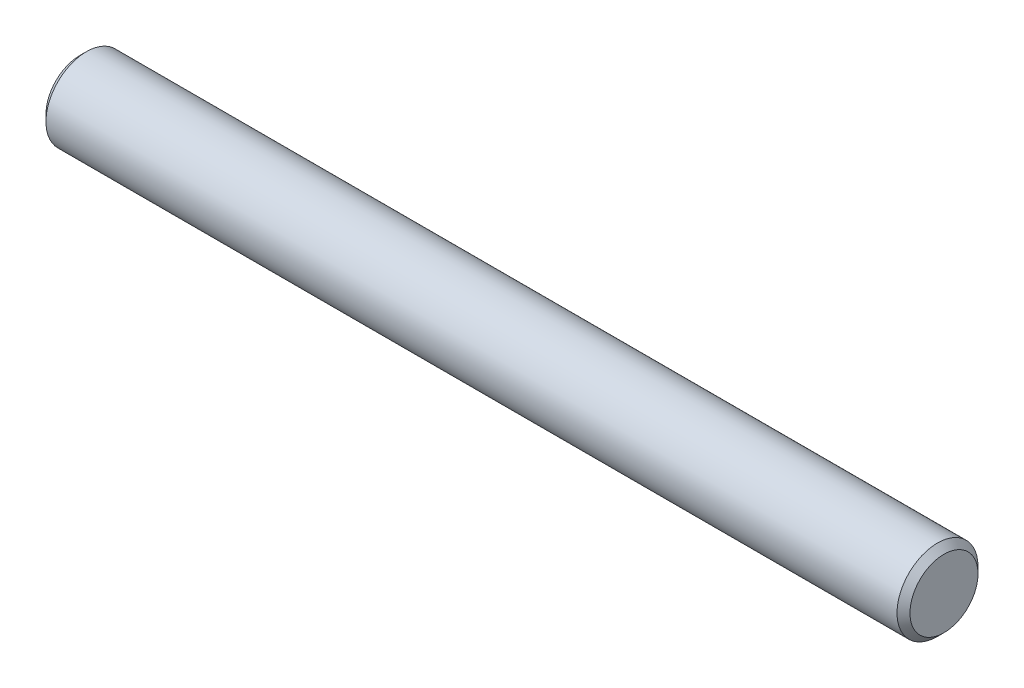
ISO-10303-21;
HEADER;
FILE_DESCRIPTION(('STEP AP214'),'2;1');
FILE_NAME('part.step','',(''),(''),'','','');
FILE_SCHEMA(('AUTOMOTIVE_DESIGN { 1 0 10303 214 1 1 1 1 }'));
ENDSEC;
DATA;
#1=APPLICATION_CONTEXT('core data for automotive mechanical design processes');
#2=APPLICATION_PROTOCOL_DEFINITION('international standard','automotive_design',2000,#1);
#3=PRODUCT_CONTEXT('',#1,'mechanical');
#4=PRODUCT('Part','Part','',(#3));
#5=PRODUCT_RELATED_PRODUCT_CATEGORY('part','',(#4));
#6=PRODUCT_DEFINITION_FORMATION('','',#4);
#7=PRODUCT_DEFINITION_CONTEXT('part definition',#1,'design');
#8=PRODUCT_DEFINITION('design','',#6,#7);
#9=PRODUCT_DEFINITION_SHAPE('','',#8);
#10=(LENGTH_UNIT() NAMED_UNIT(*) SI_UNIT(.MILLI.,.METRE.));
#11=(NAMED_UNIT(*) PLANE_ANGLE_UNIT() SI_UNIT($,.RADIAN.));
#12=(NAMED_UNIT(*) SI_UNIT($,.STERADIAN.) SOLID_ANGLE_UNIT());
#13=UNCERTAINTY_MEASURE_WITH_UNIT(LENGTH_MEASURE(1.E-05),#10,'distance_accuracy_value','');
#14=(GEOMETRIC_REPRESENTATION_CONTEXT(3) GLOBAL_UNCERTAINTY_ASSIGNED_CONTEXT((#13)) GLOBAL_UNIT_ASSIGNED_CONTEXT((#10,
#11,#12)) REPRESENTATION_CONTEXT('',''));
#15=CARTESIAN_POINT('',(0.,0.,0.));
#16=DIRECTION('',(0.,0.,1.));
#17=DIRECTION('',(1.,0.,0.));
#18=AXIS2_PLACEMENT_3D('',#15,#16,#17);
#19=CARTESIAN_POINT('',(50.8,0.,0.));
#20=DIRECTION('',(-1.,0.,0.));
#21=DIRECTION('',(0.,0.,1.));
#22=AXIS2_PLACEMENT_3D('',#19,#20,#21);
#23=CYLINDRICAL_SURFACE('',#22,2.38125);
#24=CARTESIAN_POINT('',(50.419,0.,0.));
#25=DIRECTION('',(1.,0.,0.));
#26=DIRECTION('',(0.,0.,-1.));
#27=AXIS2_PLACEMENT_3D('',#24,#25,#26);
#28=CIRCLE('',#27,2.38125);
#29=CARTESIAN_POINT('',(50.419,0.,-2.38125));
#30=VERTEX_POINT('',#29);
#31=EDGE_CURVE('E30',#30,#30,#28,.F.);
#32=ORIENTED_EDGE('',*,*,#31,.T.);
#33=EDGE_LOOP('',(#32));
#34=FACE_BOUND('',#33,.T.);
#35=CARTESIAN_POINT('',(0.380999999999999,0.,0.));
#36=DIRECTION('',(1.,0.,0.));
#37=DIRECTION('',(0.,0.,-1.));
#38=AXIS2_PLACEMENT_3D('',#35,#36,#37);
#39=CIRCLE('',#38,2.38125);
#40=CARTESIAN_POINT('',(0.380999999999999,0.,-2.38125));
#41=VERTEX_POINT('',#40);
#42=EDGE_CURVE('E34',#41,#41,#39,.T.);
#43=ORIENTED_EDGE('',*,*,#42,.T.);
#44=EDGE_LOOP('',(#43));
#45=FACE_BOUND('',#44,.T.);
#46=ADVANCED_FACE('F24',(#34,#45),#23,.T.);
#47=CARTESIAN_POINT('',(50.8,0.,0.));
#48=DIRECTION('',(1.,0.,0.));
#49=DIRECTION('',(0.,0.,-1.));
#50=AXIS2_PLACEMENT_3D('',#47,#48,#49);
#51=PLANE('',#50);
#52=CARTESIAN_POINT('',(50.8,0.,0.));
#53=DIRECTION('',(1.,0.,0.));
#54=DIRECTION('',(0.,0.,-1.));
#55=AXIS2_PLACEMENT_3D('',#52,#53,#54);
#56=CIRCLE('',#55,2.00025);
#57=CARTESIAN_POINT('',(50.8,0.,-2.00025));
#58=VERTEX_POINT('',#57);
#59=EDGE_CURVE('E38',#58,#58,#56,.T.);
#60=ORIENTED_EDGE('',*,*,#59,.T.);
#61=EDGE_LOOP('',(#60));
#62=FACE_BOUND('',#61,.T.);
#63=ADVANCED_FACE('F44',(#62),#51,.T.);
#64=CARTESIAN_POINT('',(0.,0.,0.));
#65=DIRECTION('',(1.,0.,0.));
#66=DIRECTION('',(0.,0.,-1.));
#67=AXIS2_PLACEMENT_3D('',#64,#65,#66);
#68=PLANE('',#67);
#69=CARTESIAN_POINT('',(0.,0.,0.));
#70=DIRECTION('',(1.,0.,0.));
#71=DIRECTION('',(0.,0.,-1.));
#72=AXIS2_PLACEMENT_3D('',#69,#70,#71);
#73=CIRCLE('',#72,2.00025);
#74=CARTESIAN_POINT('',(0.,0.,-2.00025));
#75=VERTEX_POINT('',#74);
#76=EDGE_CURVE('E10',#75,#75,#73,.F.);
#77=ORIENTED_EDGE('',*,*,#76,.T.);
#78=EDGE_LOOP('',(#77));
#79=FACE_BOUND('',#78,.T.);
#80=ADVANCED_FACE('F49',(#79),#68,.F.);
#81=CARTESIAN_POINT('',(50.8,0.,0.));
#82=DIRECTION('',(-1.,0.,0.));
#83=DIRECTION('',(0.,0.,1.));
#84=AXIS2_PLACEMENT_3D('',#81,#82,#83);
#85=CONICAL_SURFACE('',#84,2.00025,0.785398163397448);
#86=ORIENTED_EDGE('',*,*,#31,.F.);
#87=EDGE_LOOP('',(#86));
#88=FACE_BOUND('',#87,.T.);
#89=ORIENTED_EDGE('',*,*,#59,.F.);
#90=EDGE_LOOP('',(#89));
#91=FACE_BOUND('',#90,.T.);
#92=ADVANCED_FACE('F46',(#88,#91),#85,.T.);
#93=CARTESIAN_POINT('',(0.380999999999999,0.,0.));
#94=DIRECTION('',(1.,0.,0.));
#95=DIRECTION('',(0.,0.,-1.));
#96=AXIS2_PLACEMENT_3D('',#93,#94,#95);
#97=CONICAL_SURFACE('',#96,2.38125,0.785398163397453);
#98=ORIENTED_EDGE('',*,*,#76,.F.);
#99=EDGE_LOOP('',(#98));
#100=FACE_BOUND('',#99,.T.);
#101=ORIENTED_EDGE('',*,*,#42,.F.);
#102=EDGE_LOOP('',(#101));
#103=FACE_BOUND('',#102,.T.);
#104=ADVANCED_FACE('F48',(#100,#103),#97,.T.);
#105=CLOSED_SHELL('',(#46,#63,#80,#92,#104));
#106=MANIFOLD_SOLID_BREP('B2',#105);
#107=ADVANCED_BREP_SHAPE_REPRESENTATION('',(#18,#106),#14);
#108=SHAPE_DEFINITION_REPRESENTATION(#9,#107);
ENDSEC;
END-ISO-10303-21;
